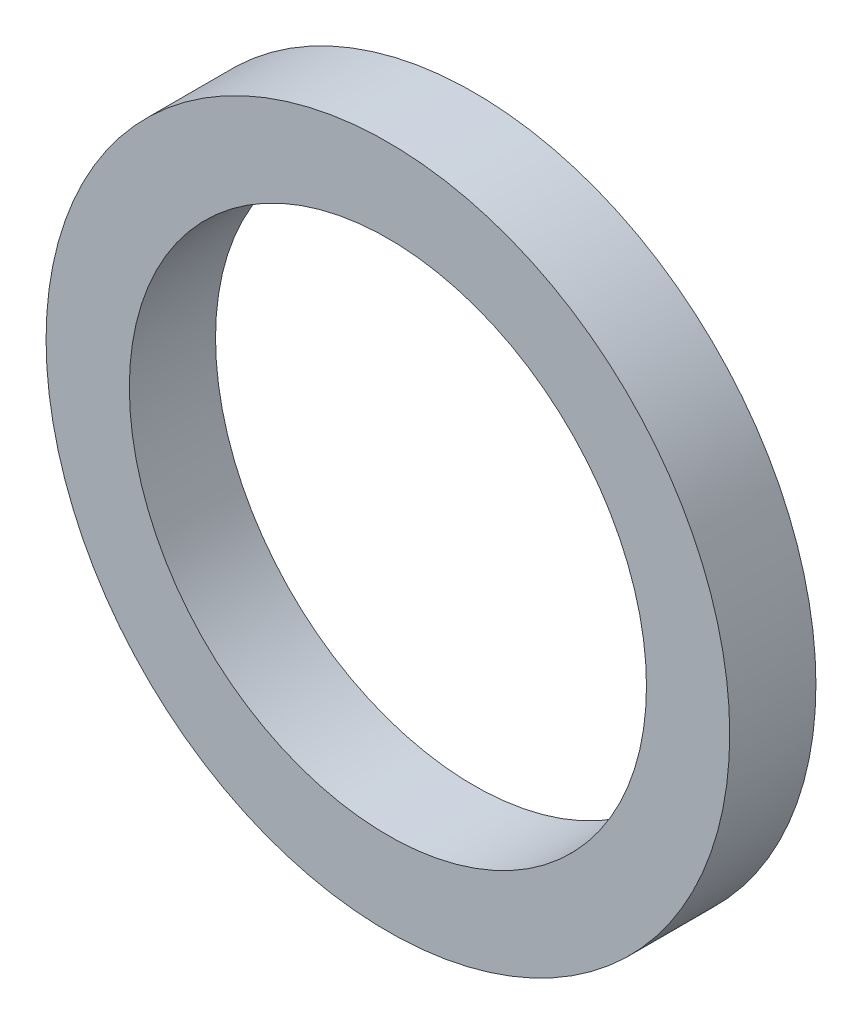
from build123d import *

# Parameters (mm, degrees)
SKETCH1_R           = 25.1841
SKETCH1_R_2         = 19.05
BOSS_EXTRUDE1_DEPTH = 6.35


with BuildPart() as part:
    # Sketch1 → Boss-Extrude1 (new body)
    with BuildSketch(Plane.XY):
        Circle(SKETCH1_R)
        Circle(SKETCH1_R_2, mode=Mode.SUBTRACT)
    extrude(amount=BOSS_EXTRUDE1_DEPTH)


solid = part.part
